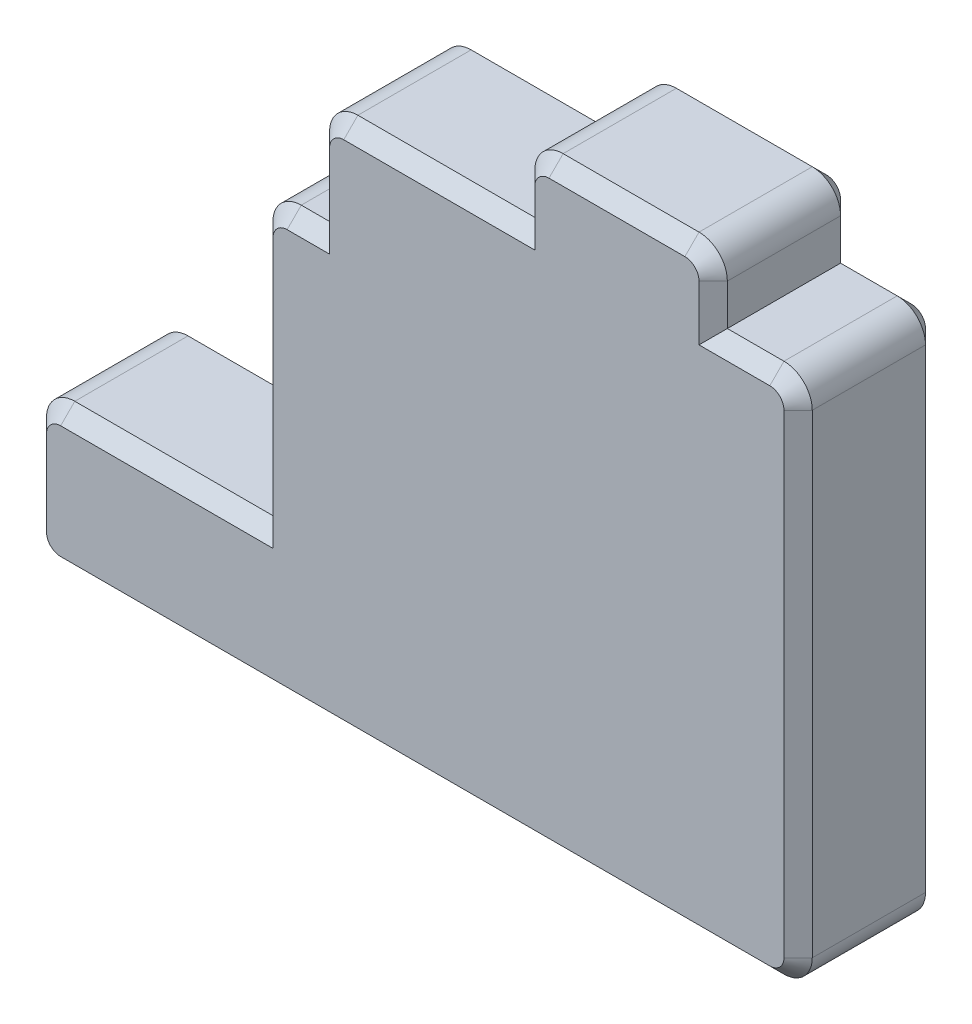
from build123d import *

# Parameters (mm, degrees)
DODANIE_WYCI_GNI_CIE1_DEPTH = 5
ZAOKR_GLENIE1_R             = 1
SFAZOWANIE1_SIZE            = 0.5


with BuildPart() as part:
    # Szkic2 → Dodanie-wyci_gni_cie1 (new body)
    with BuildSketch(Plane.XY):
        Polygon((-72.18101996, -16.030587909), (-64.18101996, -16.030587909), (-64.18101996, -6.030587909), (-62.18101996, -6.030587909), (-62.18101996, -2.280587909), (-54.93101996, -2.280587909), (-54.93101996, 0.169412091), (-48.13101996, 0.169412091), (-48.13101996, -2.280587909), (-45.13101996, -2.280587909), (-45.13101996, -21.030587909), (-72.18101996, -21.030587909), align=None)
    extrude(amount=DODANIE_WYCI_GNI_CIE1_DEPTH)

    # Zaokr_glenie1
    zaokr_glenie1_edges = [part.edges().sort_by_distance(p)[0] for p in [
        (-72.18101996, -16.030587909, 2.5),
        (-64.18101996, -6.030587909, 2.5),
        (-62.18101996, -2.280587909, 2.5),
        (-54.93101996, 0.169412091, 2.5),
        (-48.13101996, 0.169412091, 2.5),
        (-45.13101996, -2.280587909, 2.5),
        (-45.13101996, -21.030587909, 2.5),
        (-72.18101996, -21.030587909, 2.5),
    ]]
    fillet(zaokr_glenie1_edges, radius=ZAOKR_GLENIE1_R)

    # Sfazowanie1
    sfazowanie1_edges = [part.edges().sort_by_distance(p)[0] for p in [
        (-67.68101996, -16.030587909, 0),
        (-62.68101996, -6.030587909, 0),
        (-58.05601996, -2.280587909, 0),
        (-48.13101996, -1.555587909, 0),
        (-48.13101996, -1.555587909, 5),
        (-58.05601996, -2.280587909, 5),
        (-58.65601996, -21.030587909, 0),
        (-58.65601996, -21.030587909, 5),
        (-72.18101996, -18.530587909, 0),
        (-64.18101996, -11.530587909, 0),
        (-62.18101996, -4.655587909, 0),
        (-54.93101996, -1.555587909, 0),
        (-51.53101996, 0.169412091, 0),
        (-47.13101996, -2.280587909, 0),
        (-62.68101996, -6.030587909, 5),
        (-45.13101996, -11.655587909, 0),
        (-61.888126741, -2.573481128, 0),
        (-54.638126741, -0.123481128, 0),
        (-48.423913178, -0.123481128, 0),
        (-45.423913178, -2.573481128, 0),
        (-45.423913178, -20.73769469, 0),
        (-63.888126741, -6.323481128, 0),
        (-71.888126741, -16.323481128, 0),
        (-71.888126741, -20.73769469, 0),
        (-72.18101996, -18.530587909, 5),
        (-45.13101996, -11.655587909, 5),
        (-47.13101996, -2.280587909, 5),
        (-51.53101996, 0.169412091, 5),
        (-67.68101996, -16.030587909, 5),
        (-54.93101996, -1.555587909, 5),
        (-62.18101996, -4.655587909, 5),
        (-64.18101996, -11.530587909, 5),
        (-61.888126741, -2.573481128, 5),
        (-54.638126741, -0.123481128, 5),
        (-48.423913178, -0.123481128, 5),
        (-45.423913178, -2.573481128, 5),
        (-45.423913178, -20.73769469, 5),
        (-63.888126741, -6.323481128, 5),
        (-71.888126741, -16.323481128, 5),
        (-71.888126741, -20.73769469, 5),
    ]]
    chamfer(sfazowanie1_edges, length=SFAZOWANIE1_SIZE)


solid = part.part
